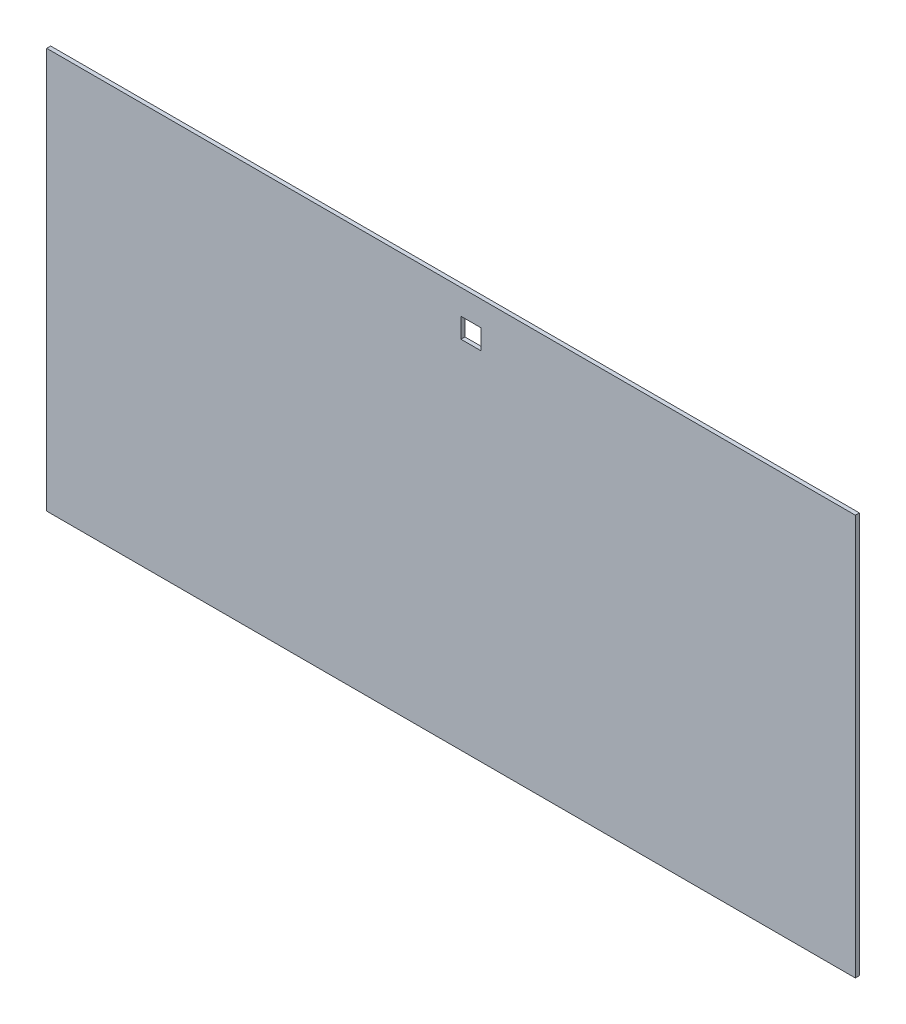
ISO-10303-21;
HEADER;
FILE_DESCRIPTION(('STEP AP214'),'2;1');
FILE_NAME('part.step','',(''),(''),'','','');
FILE_SCHEMA(('AUTOMOTIVE_DESIGN { 1 0 10303 214 1 1 1 1 }'));
ENDSEC;
DATA;
#1=APPLICATION_CONTEXT('core data for automotive mechanical design processes');
#2=APPLICATION_PROTOCOL_DEFINITION('international standard','automotive_design',2000,#1);
#3=PRODUCT_CONTEXT('',#1,'mechanical');
#4=PRODUCT('Part','Part','',(#3));
#5=PRODUCT_RELATED_PRODUCT_CATEGORY('part','',(#4));
#6=PRODUCT_DEFINITION_FORMATION('','',#4);
#7=PRODUCT_DEFINITION_CONTEXT('part definition',#1,'design');
#8=PRODUCT_DEFINITION('design','',#6,#7);
#9=PRODUCT_DEFINITION_SHAPE('','',#8);
#10=(LENGTH_UNIT() NAMED_UNIT(*) SI_UNIT(.MILLI.,.METRE.));
#11=(NAMED_UNIT(*) PLANE_ANGLE_UNIT() SI_UNIT($,.RADIAN.));
#12=(NAMED_UNIT(*) SI_UNIT($,.STERADIAN.) SOLID_ANGLE_UNIT());
#13=UNCERTAINTY_MEASURE_WITH_UNIT(LENGTH_MEASURE(1.E-05),#10,'distance_accuracy_value','');
#14=(GEOMETRIC_REPRESENTATION_CONTEXT(3) GLOBAL_UNCERTAINTY_ASSIGNED_CONTEXT((#13)) GLOBAL_UNIT_ASSIGNED_CONTEXT((#10,
#11,#12)) REPRESENTATION_CONTEXT('',''));
#15=CARTESIAN_POINT('',(0.,0.,0.));
#16=DIRECTION('',(0.,0.,1.));
#17=DIRECTION('',(1.,0.,0.));
#18=AXIS2_PLACEMENT_3D('',#15,#16,#17);
#19=CARTESIAN_POINT('',(406.,-201.25,4.));
#20=DIRECTION('',(-1.,0.,0.));
#21=DIRECTION('',(0.,0.,1.));
#22=AXIS2_PLACEMENT_3D('',#19,#20,#21);
#23=PLANE('',#22);
#24=DIRECTION('',(0.,1.,0.));
#25=VECTOR('',#24,1.);
#26=CARTESIAN_POINT('',(406.,-201.25,0.));
#27=LINE('',#26,#25);
#28=CARTESIAN_POINT('',(406.,-201.25,0.));
#29=VERTEX_POINT('',#28);
#30=CARTESIAN_POINT('',(406.,201.25,0.));
#31=VERTEX_POINT('',#30);
#32=EDGE_CURVE('E135',#29,#31,#27,.T.);
#33=ORIENTED_EDGE('',*,*,#32,.T.);
#34=DIRECTION('',(0.,0.,-1.));
#35=VECTOR('',#34,1.);
#36=CARTESIAN_POINT('',(406.,201.25,4.));
#37=LINE('',#36,#35);
#38=CARTESIAN_POINT('',(406.,201.25,4.));
#39=VERTEX_POINT('',#38);
#40=EDGE_CURVE('E11',#39,#31,#37,.T.);
#41=ORIENTED_EDGE('',*,*,#40,.F.);
#42=DIRECTION('',(0.,1.,0.));
#43=VECTOR('',#42,1.);
#44=CARTESIAN_POINT('',(406.,-201.25,4.));
#45=LINE('',#44,#43);
#46=CARTESIAN_POINT('',(406.,-201.25,4.));
#47=VERTEX_POINT('',#46);
#48=EDGE_CURVE('E139',#47,#39,#45,.T.);
#49=ORIENTED_EDGE('',*,*,#48,.F.);
#50=DIRECTION('',(0.,0.,-1.));
#51=VECTOR('',#50,1.);
#52=CARTESIAN_POINT('',(406.,-201.25,4.));
#53=LINE('',#52,#51);
#54=EDGE_CURVE('E150',#47,#29,#53,.T.);
#55=ORIENTED_EDGE('',*,*,#54,.T.);
#56=EDGE_LOOP('',(#33,#41,#49,#55));
#57=FACE_BOUND('',#56,.T.);
#58=ADVANCED_FACE('F38',(#57),#23,.F.);
#59=CARTESIAN_POINT('',(-406.,201.25,4.));
#60=DIRECTION('',(0.,-1.,0.));
#61=DIRECTION('',(0.,0.,-1.));
#62=AXIS2_PLACEMENT_3D('',#59,#60,#61);
#63=PLANE('',#62);
#64=DIRECTION('',(-1.,0.,0.));
#65=VECTOR('',#64,1.);
#66=CARTESIAN_POINT('',(-406.,201.25,0.));
#67=LINE('',#66,#65);
#68=CARTESIAN_POINT('',(-406.,201.25,0.));
#69=VERTEX_POINT('',#68);
#70=EDGE_CURVE('E153',#31,#69,#67,.T.);
#71=ORIENTED_EDGE('',*,*,#70,.T.);
#72=DIRECTION('',(0.,0.,-1.));
#73=VECTOR('',#72,1.);
#74=CARTESIAN_POINT('',(-406.,201.25,4.));
#75=LINE('',#74,#73);
#76=CARTESIAN_POINT('',(-406.,201.25,4.));
#77=VERTEX_POINT('',#76);
#78=EDGE_CURVE('E45',#77,#69,#75,.T.);
#79=ORIENTED_EDGE('',*,*,#78,.F.);
#80=DIRECTION('',(-1.,0.,0.));
#81=VECTOR('',#80,1.);
#82=CARTESIAN_POINT('',(-406.,201.25,4.));
#83=LINE('',#82,#81);
#84=EDGE_CURVE('E142',#39,#77,#83,.T.);
#85=ORIENTED_EDGE('',*,*,#84,.F.);
#86=ORIENTED_EDGE('',*,*,#40,.T.);
#87=EDGE_LOOP('',(#71,#79,#85,#86));
#88=FACE_BOUND('',#87,.T.);
#89=ADVANCED_FACE('F182',(#88),#63,.F.);
#90=CARTESIAN_POINT('',(-406.,-201.25,4.));
#91=DIRECTION('',(1.,0.,0.));
#92=DIRECTION('',(0.,0.,-1.));
#93=AXIS2_PLACEMENT_3D('',#90,#91,#92);
#94=PLANE('',#93);
#95=DIRECTION('',(0.,-1.,0.));
#96=VECTOR('',#95,1.);
#97=CARTESIAN_POINT('',(-406.,-201.25,0.));
#98=LINE('',#97,#96);
#99=CARTESIAN_POINT('',(-406.,-201.25,0.));
#100=VERTEX_POINT('',#99);
#101=EDGE_CURVE('E156',#69,#100,#98,.T.);
#102=ORIENTED_EDGE('',*,*,#101,.T.);
#103=DIRECTION('',(0.,0.,-1.));
#104=VECTOR('',#103,1.);
#105=CARTESIAN_POINT('',(-406.,-201.25,4.));
#106=LINE('',#105,#104);
#107=CARTESIAN_POINT('',(-406.,-201.25,4.));
#108=VERTEX_POINT('',#107);
#109=EDGE_CURVE('E161',#108,#100,#106,.T.);
#110=ORIENTED_EDGE('',*,*,#109,.F.);
#111=DIRECTION('',(0.,-1.,0.));
#112=VECTOR('',#111,1.);
#113=CARTESIAN_POINT('',(-406.,-201.25,4.));
#114=LINE('',#113,#112);
#115=EDGE_CURVE('E146',#77,#108,#114,.T.);
#116=ORIENTED_EDGE('',*,*,#115,.F.);
#117=ORIENTED_EDGE('',*,*,#78,.T.);
#118=EDGE_LOOP('',(#102,#110,#116,#117));
#119=FACE_BOUND('',#118,.T.);
#120=ADVANCED_FACE('F168',(#119),#94,.F.);
#121=CARTESIAN_POINT('',(-406.,-201.25,4.));
#122=DIRECTION('',(0.,1.,0.));
#123=DIRECTION('',(0.,0.,1.));
#124=AXIS2_PLACEMENT_3D('',#121,#122,#123);
#125=PLANE('',#124);
#126=DIRECTION('',(1.,0.,0.));
#127=VECTOR('',#126,1.);
#128=CARTESIAN_POINT('',(-406.,-201.25,0.));
#129=LINE('',#128,#127);
#130=EDGE_CURVE('E143',#100,#29,#129,.T.);
#131=ORIENTED_EDGE('',*,*,#130,.T.);
#132=ORIENTED_EDGE('',*,*,#54,.F.);
#133=DIRECTION('',(1.,0.,0.));
#134=VECTOR('',#133,1.);
#135=CARTESIAN_POINT('',(-406.,-201.25,4.));
#136=LINE('',#135,#134);
#137=EDGE_CURVE('E148',#108,#47,#136,.T.);
#138=ORIENTED_EDGE('',*,*,#137,.F.);
#139=ORIENTED_EDGE('',*,*,#109,.T.);
#140=EDGE_LOOP('',(#131,#132,#138,#139));
#141=FACE_BOUND('',#140,.T.);
#142=ADVANCED_FACE('F175',(#141),#125,.F.);
#143=CARTESIAN_POINT('',(0.,0.,4.));
#144=DIRECTION('',(0.,0.,-1.));
#145=DIRECTION('',(-1.,0.,0.));
#146=AXIS2_PLACEMENT_3D('',#143,#144,#145);
#147=PLANE('',#146);
#148=DIRECTION('',(1.,0.,0.));
#149=VECTOR('',#148,1.);
#150=CARTESIAN_POINT('',(9.99999999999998,156.25,4.));
#151=LINE('',#150,#149);
#152=CARTESIAN_POINT('',(9.99999999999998,156.25,4.));
#153=VERTEX_POINT('',#152);
#154=CARTESIAN_POINT('',(30.,156.25,4.));
#155=VERTEX_POINT('',#154);
#156=EDGE_CURVE('E129',#153,#155,#151,.T.);
#157=ORIENTED_EDGE('',*,*,#156,.F.);
#158=DIRECTION('',(0.,-1.,0.));
#159=VECTOR('',#158,1.);
#160=CARTESIAN_POINT('',(9.99999999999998,176.25,4.));
#161=LINE('',#160,#159);
#162=CARTESIAN_POINT('',(9.99999999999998,176.25,4.));
#163=VERTEX_POINT('',#162);
#164=EDGE_CURVE('E52',#163,#153,#161,.T.);
#165=ORIENTED_EDGE('',*,*,#164,.F.);
#166=DIRECTION('',(-1.,0.,0.));
#167=VECTOR('',#166,1.);
#168=CARTESIAN_POINT('',(9.99999999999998,176.25,4.));
#169=LINE('',#168,#167);
#170=CARTESIAN_POINT('',(30.,176.25,4.));
#171=VERTEX_POINT('',#170);
#172=EDGE_CURVE('E120',#171,#163,#169,.T.);
#173=ORIENTED_EDGE('',*,*,#172,.F.);
#174=DIRECTION('',(0.,1.,0.));
#175=VECTOR('',#174,1.);
#176=CARTESIAN_POINT('',(30.,176.25,4.));
#177=LINE('',#176,#175);
#178=EDGE_CURVE('E123',#155,#171,#177,.T.);
#179=ORIENTED_EDGE('',*,*,#178,.F.);
#180=EDGE_LOOP('',(#157,#165,#173,#179));
#181=FACE_BOUND('',#180,.T.);
#182=ORIENTED_EDGE('',*,*,#48,.T.);
#183=ORIENTED_EDGE('',*,*,#84,.T.);
#184=ORIENTED_EDGE('',*,*,#115,.T.);
#185=ORIENTED_EDGE('',*,*,#137,.T.);
#186=EDGE_LOOP('',(#182,#183,#184,#185));
#187=FACE_BOUND('',#186,.T.);
#188=ADVANCED_FACE('F181',(#181,#187),#147,.F.);
#189=CARTESIAN_POINT('',(0.,0.,0.));
#190=DIRECTION('',(0.,0.,-1.));
#191=DIRECTION('',(-1.,0.,0.));
#192=AXIS2_PLACEMENT_3D('',#189,#190,#191);
#193=PLANE('',#192);
#194=DIRECTION('',(0.,-1.,0.));
#195=VECTOR('',#194,1.);
#196=CARTESIAN_POINT('',(9.99999999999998,176.25,0.));
#197=LINE('',#196,#195);
#198=CARTESIAN_POINT('',(9.99999999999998,176.25,0.));
#199=VERTEX_POINT('',#198);
#200=CARTESIAN_POINT('',(9.99999999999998,156.25,0.));
#201=VERTEX_POINT('',#200);
#202=EDGE_CURVE('E104',#199,#201,#197,.T.);
#203=ORIENTED_EDGE('',*,*,#202,.T.);
#204=DIRECTION('',(1.,0.,0.));
#205=VECTOR('',#204,1.);
#206=CARTESIAN_POINT('',(9.99999999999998,156.25,0.));
#207=LINE('',#206,#205);
#208=CARTESIAN_POINT('',(30.,156.25,0.));
#209=VERTEX_POINT('',#208);
#210=EDGE_CURVE('E113',#201,#209,#207,.T.);
#211=ORIENTED_EDGE('',*,*,#210,.T.);
#212=DIRECTION('',(0.,1.,0.));
#213=VECTOR('',#212,1.);
#214=CARTESIAN_POINT('',(30.,176.25,0.));
#215=LINE('',#214,#213);
#216=CARTESIAN_POINT('',(30.,176.25,0.));
#217=VERTEX_POINT('',#216);
#218=EDGE_CURVE('E60',#209,#217,#215,.T.);
#219=ORIENTED_EDGE('',*,*,#218,.T.);
#220=DIRECTION('',(-1.,0.,0.));
#221=VECTOR('',#220,1.);
#222=CARTESIAN_POINT('',(9.99999999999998,176.25,0.));
#223=LINE('',#222,#221);
#224=EDGE_CURVE('E110',#217,#199,#223,.T.);
#225=ORIENTED_EDGE('',*,*,#224,.T.);
#226=EDGE_LOOP('',(#203,#211,#219,#225));
#227=FACE_BOUND('',#226,.T.);
#228=ORIENTED_EDGE('',*,*,#32,.F.);
#229=ORIENTED_EDGE('',*,*,#130,.F.);
#230=ORIENTED_EDGE('',*,*,#101,.F.);
#231=ORIENTED_EDGE('',*,*,#70,.F.);
#232=EDGE_LOOP('',(#228,#229,#230,#231));
#233=FACE_BOUND('',#232,.T.);
#234=ADVANCED_FACE('F117',(#227,#233),#193,.T.);
#235=CARTESIAN_POINT('',(9.99999999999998,176.25,0.));
#236=DIRECTION('',(-1.,0.,0.));
#237=DIRECTION('',(0.,-1.,0.));
#238=AXIS2_PLACEMENT_3D('',#235,#236,#237);
#239=PLANE('',#238);
#240=ORIENTED_EDGE('',*,*,#164,.T.);
#241=DIRECTION('',(0.,0.,1.));
#242=VECTOR('',#241,1.);
#243=CARTESIAN_POINT('',(9.99999999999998,156.25,0.));
#244=LINE('',#243,#242);
#245=EDGE_CURVE('E100',#201,#153,#244,.T.);
#246=ORIENTED_EDGE('',*,*,#245,.F.);
#247=ORIENTED_EDGE('',*,*,#202,.F.);
#248=DIRECTION('',(0.,0.,1.));
#249=VECTOR('',#248,1.);
#250=CARTESIAN_POINT('',(9.99999999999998,176.25,0.));
#251=LINE('',#250,#249);
#252=EDGE_CURVE('E133',#199,#163,#251,.T.);
#253=ORIENTED_EDGE('',*,*,#252,.T.);
#254=EDGE_LOOP('',(#240,#246,#247,#253));
#255=FACE_BOUND('',#254,.T.);
#256=ADVANCED_FACE('F102',(#255),#239,.F.);
#257=CARTESIAN_POINT('',(9.99999999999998,176.25,0.));
#258=DIRECTION('',(0.,1.,0.));
#259=DIRECTION('',(0.,0.,1.));
#260=AXIS2_PLACEMENT_3D('',#257,#258,#259);
#261=PLANE('',#260);
#262=ORIENTED_EDGE('',*,*,#172,.T.);
#263=ORIENTED_EDGE('',*,*,#252,.F.);
#264=ORIENTED_EDGE('',*,*,#224,.F.);
#265=DIRECTION('',(0.,0.,1.));
#266=VECTOR('',#265,1.);
#267=CARTESIAN_POINT('',(30.,176.25,0.));
#268=LINE('',#267,#266);
#269=EDGE_CURVE('E136',#217,#171,#268,.T.);
#270=ORIENTED_EDGE('',*,*,#269,.T.);
#271=EDGE_LOOP('',(#262,#263,#264,#270));
#272=FACE_BOUND('',#271,.T.);
#273=ADVANCED_FACE('F199',(#272),#261,.F.);
#274=CARTESIAN_POINT('',(30.,176.25,0.));
#275=DIRECTION('',(1.,0.,0.));
#276=DIRECTION('',(0.,1.,0.));
#277=AXIS2_PLACEMENT_3D('',#274,#275,#276);
#278=PLANE('',#277);
#279=ORIENTED_EDGE('',*,*,#178,.T.);
#280=ORIENTED_EDGE('',*,*,#269,.F.);
#281=ORIENTED_EDGE('',*,*,#218,.F.);
#282=DIRECTION('',(0.,0.,1.));
#283=VECTOR('',#282,1.);
#284=CARTESIAN_POINT('',(30.,156.25,0.));
#285=LINE('',#284,#283);
#286=EDGE_CURVE('E109',#209,#155,#285,.T.);
#287=ORIENTED_EDGE('',*,*,#286,.T.);
#288=EDGE_LOOP('',(#279,#280,#281,#287));
#289=FACE_BOUND('',#288,.T.);
#290=ADVANCED_FACE('F202',(#289),#278,.F.);
#291=CARTESIAN_POINT('',(9.99999999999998,156.25,0.));
#292=DIRECTION('',(0.,-1.,0.));
#293=DIRECTION('',(0.,0.,-1.));
#294=AXIS2_PLACEMENT_3D('',#291,#292,#293);
#295=PLANE('',#294);
#296=ORIENTED_EDGE('',*,*,#156,.T.);
#297=ORIENTED_EDGE('',*,*,#286,.F.);
#298=ORIENTED_EDGE('',*,*,#210,.F.);
#299=ORIENTED_EDGE('',*,*,#245,.T.);
#300=EDGE_LOOP('',(#296,#297,#298,#299));
#301=FACE_BOUND('',#300,.T.);
#302=ADVANCED_FACE('F114',(#301),#295,.F.);
#303=CLOSED_SHELL('',(#58,#89,#120,#142,#188,#234,#256,#273,#290,#302));
#304=MANIFOLD_SOLID_BREP('B2',#303);
#305=ADVANCED_BREP_SHAPE_REPRESENTATION('',(#18,#304),#14);
#306=SHAPE_DEFINITION_REPRESENTATION(#9,#305);
ENDSEC;
END-ISO-10303-21;
